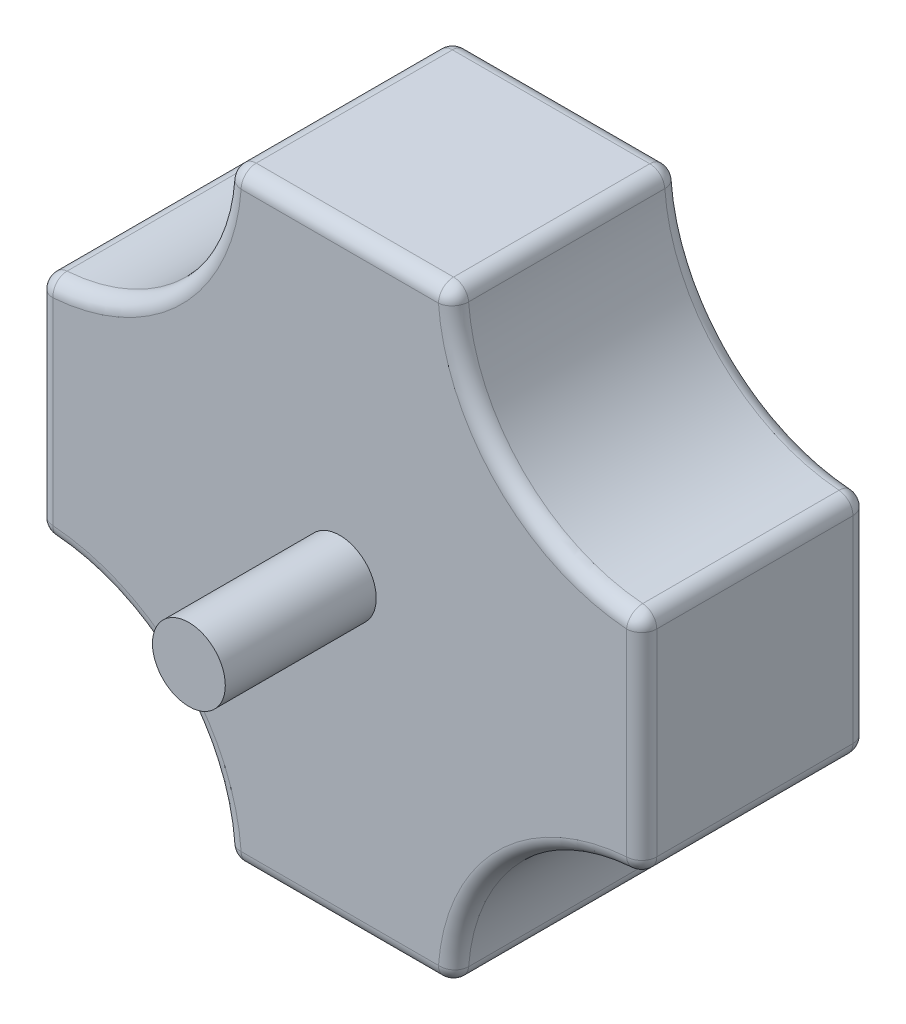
from build123d import *

# Parameters (mm, degrees)
SKETCH1_W           = 40
SKETCH1_H           = 40
BOSS_EXTRUDE1_DEPTH = 15
SKETCH2_R           = 12.5
CUT_EXTRUDE1_DEPTH  = 33.015621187
FILLET1_R           = 1
SKETCH3_R           = 2.413
BOSS_EXTRUDE2_DEPTH = 10


with BuildPart() as part:
    # Sketch1 → Boss-Extrude1 (new body)
    with BuildSketch(Plane.XY):
        Rectangle(SKETCH1_W, SKETCH1_H)
    extrude(amount=BOSS_EXTRUDE1_DEPTH)

    # Sketch2 → Cut-Extrude1 (cut, through all)
    with BuildSketch(Plane.XY.offset(15)):
        with Locations((-20, 20)):
            Circle(SKETCH2_R)
        with Locations((-20, -20)):
            Circle(SKETCH2_R)
        with Locations((20, -20)):
            Circle(SKETCH2_R)
        with Locations((20, 20)):
            Circle(SKETCH2_R)
    extrude(amount=-CUT_EXTRUDE1_DEPTH, mode=Mode.SUBTRACT)

    # Fillet1
    fillet1_edges = [part.edges().sort_by_distance(p)[0] for p in [
        (-20, 0, 0),
        (-11.161165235, 11.161165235, 0),
        (-20, 0, 15),
        (-11.161165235, 11.161165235, 15),
        (-7.5, 20, 7.5),
        (-20, 7.5, 7.5),
        (0, -20, 0),
        (0, -20, 15),
        (-11.161165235, -11.161165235, 15),
        (-11.161165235, -11.161165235, 0),
        (-20, -7.5, 7.5),
        (-7.5, -20, 7.5),
        (20, 0, 0),
        (20, 0, 15),
        (11.161165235, -11.161165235, 15),
        (20, -7.5, 7.5),
        (11.161165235, -11.161165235, 0),
        (7.5, -20, 7.5),
        (0, 20, 0),
        (0, 20, 15),
        (11.161165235, 11.161165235, 15),
        (11.161165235, 11.161165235, 0),
        (20, 7.5, 7.5),
        (7.5, 20, 7.5),
    ]]
    fillet(fillet1_edges, radius=FILLET1_R)

    # Sketch3 → Boss-Extrude2 (add)
    with BuildSketch(Plane.XY.offset(15)):
        with Locations(Location((0, 0, 0), (0, 0, 180))):
            Circle(SKETCH3_R)
    extrude(amount=BOSS_EXTRUDE2_DEPTH)


solid = part.part
